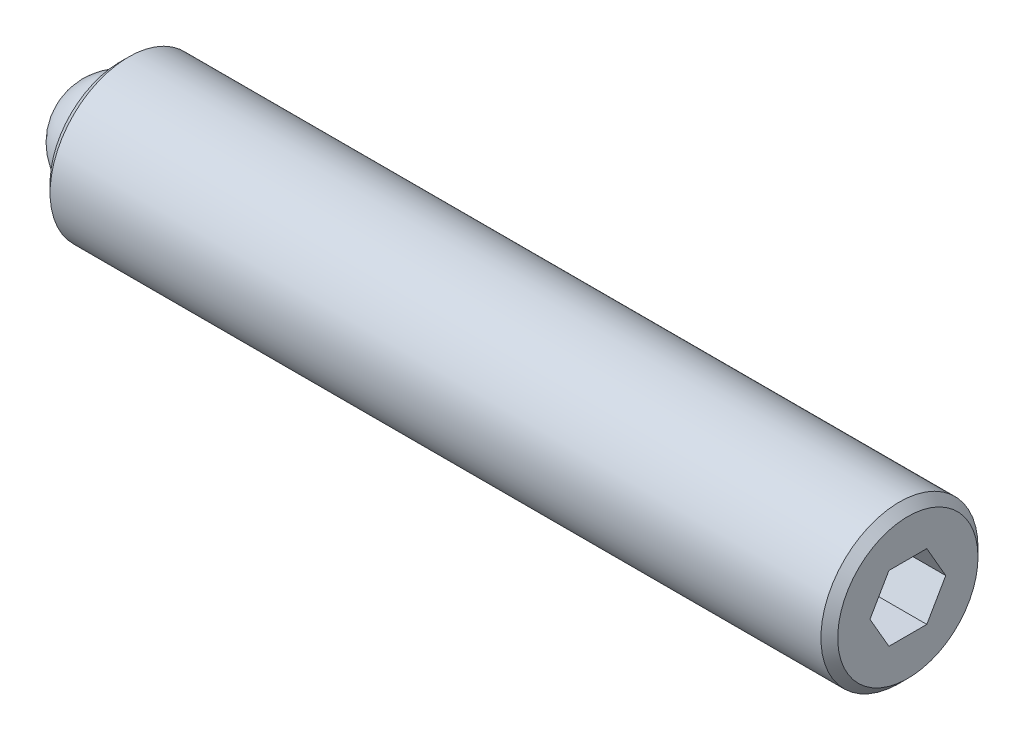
from build123d import *

# Parameters (mm, degrees)
SKETCH2_R           = 2.3749
BOSS_EXTRUDE1_DEPTH = 23.8125
CHAMFER1_SIZE       = 0.254
CHAMFER2_SIZE       = 0.254
CUT_EXTRUDE2_DEPTH  = 2.286
SKETCH3_R           = 1.5875
CUT_EXTRUDE3_DEPTH  = 1.5875
CUT_EXTRUDE6_DEPTH  = 1.5875


with BuildPart() as part:
    # Sketch2 → Boss-Extrude1 (new body)
    with BuildSketch(Plane(origin=(0, 0, 0), x_dir=(0, 0, -1), z_dir=(1, 0, 0))):
        Circle(SKETCH2_R)
    extrude(amount=BOSS_EXTRUDE1_DEPTH)

    # Chamfer1
    chamfer1_edges = [part.edges().sort_by_distance(p)[0] for p in [
        (0, 0, 2.3749),
    ]]
    chamfer(chamfer1_edges, length=CHAMFER1_SIZE)

    # Chamfer2
    chamfer2_edges = [part.edges().sort_by_distance(p)[0] for p in [
        (23.8125, 0, 2.3749),
    ]]
    chamfer(chamfer2_edges, length=CHAMFER2_SIZE)

    # Sketch4 → Cut-Extrude2 (cut)
    with BuildSketch(Plane(origin=(23.8125, 0, 0), x_dir=(0, 0, -1), z_dir=(1, 0, 0))):
        Polygon((1.14567944, 0), (0.57283972, 0.9921875), (-0.57283972, 0.9921875), (-1.14567944, 0), (-0.57283972, -0.9921875), (0.57283972, -0.9921875), align=None)
    extrude(amount=-CUT_EXTRUDE2_DEPTH, mode=Mode.SUBTRACT)

    # Sketch3 → Cut-Extrude3 (cut)
    with BuildSketch(Plane.ZY):
        Circle(SKETCH3_R)
    extrude(amount=-CUT_EXTRUDE3_DEPTH, mode=Mode.SUBTRACT)

    # Sketch6 → Cut-Extrude6 (cut)
    with BuildSketch(Plane.ZY):
        with BuildLine():
            ThreePointArc((0.063487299, 1.58623), (0, 1.5875), (-0.063487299, 1.58623))
            ThreePointArc((-0.063487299, 1.58623), (0, 1.651), (0.063487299, 1.58623))
        make_face()
    extrude(amount=-CUT_EXTRUDE6_DEPTH, mode=Mode.SUBTRACT)


with BuildPart() as body_2:
    # Sketch5 → Revolve1 (revolve)
    with BuildSketch(Plane.ZY):
        with BuildLine():
            Line((0, 0), (0, -1.5875))
            ThreePointArc((0, -1.5875), (-1.5875, 0), (0, 1.5875))
            Line((0, 1.5875), (0, 0))
        make_face()
    revolve(axis=Axis((0, 0, 0), (0, 1, 0)))


solid = Compound([part.part, body_2.part])
